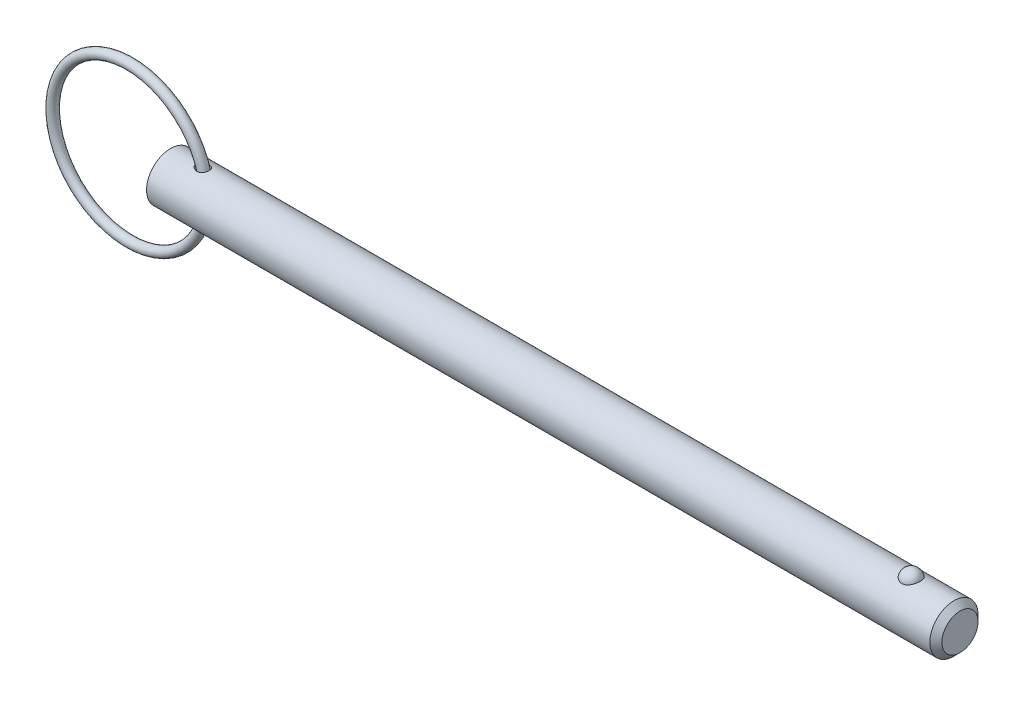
ISO-10303-21;
HEADER;
FILE_DESCRIPTION(('STEP AP214'),'2;1');
FILE_NAME('part.step','',(''),(''),'','','');
FILE_SCHEMA(('AUTOMOTIVE_DESIGN { 1 0 10303 214 1 1 1 1 }'));
ENDSEC;
DATA;
#1=APPLICATION_CONTEXT('core data for automotive mechanical design processes');
#2=APPLICATION_PROTOCOL_DEFINITION('international standard','automotive_design',2000,#1);
#3=PRODUCT_CONTEXT('',#1,'mechanical');
#4=PRODUCT('Part','Part','',(#3));
#5=PRODUCT_RELATED_PRODUCT_CATEGORY('part','',(#4));
#6=PRODUCT_DEFINITION_FORMATION('','',#4);
#7=PRODUCT_DEFINITION_CONTEXT('part definition',#1,'design');
#8=PRODUCT_DEFINITION('design','',#6,#7);
#9=PRODUCT_DEFINITION_SHAPE('','',#8);
#10=(LENGTH_UNIT() NAMED_UNIT(*) SI_UNIT(.MILLI.,.METRE.));
#11=(NAMED_UNIT(*) PLANE_ANGLE_UNIT() SI_UNIT($,.RADIAN.));
#12=(NAMED_UNIT(*) SI_UNIT($,.STERADIAN.) SOLID_ANGLE_UNIT());
#13=UNCERTAINTY_MEASURE_WITH_UNIT(LENGTH_MEASURE(1.E-05),#10,'distance_accuracy_value','');
#14=(GEOMETRIC_REPRESENTATION_CONTEXT(3) GLOBAL_UNCERTAINTY_ASSIGNED_CONTEXT((#13)) GLOBAL_UNIT_ASSIGNED_CONTEXT((#10,
#11,#12)) REPRESENTATION_CONTEXT('',''));
#15=CARTESIAN_POINT('',(0.,0.,0.));
#16=DIRECTION('',(0.,0.,1.));
#17=DIRECTION('',(1.,0.,0.));
#18=AXIS2_PLACEMENT_3D('',#15,#16,#17);
#19=CARTESIAN_POINT('',(-6.75433730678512,0.,0.));
#20=DIRECTION('',(0.,0.,1.));
#21=DIRECTION('',(1.,0.,0.));
#22=AXIS2_PLACEMENT_3D('',#19,#20,#21);
#23=TOROIDAL_SURFACE('',#22,12.7,0.794);
#24=CARTESIAN_POINT('',(6.73966269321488,0.,0.));
#25=VERTEX_POINT('',#24);
#26=VERTEX_LOOP('',#25);
#27=FACE_BOUND('',#26,.T.);
#28=ADVANCED_FACE('P0_F12',(#27),#23,.T.);
#29=CLOSED_SHELL('',(#28));
#30=MANIFOLD_SOLID_BREP('P0_B1',#29);
#31=CARTESIAN_POINT('',(0.,0.,0.));
#32=DIRECTION('',(1.,0.,0.));
#33=DIRECTION('',(0.,0.,-1.));
#34=AXIS2_PLACEMENT_3D('',#31,#32,#33);
#35=CYLINDRICAL_SURFACE('',#34,3.97);
#36=CARTESIAN_POINT('',(4.50613409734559,3.92152479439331,-0.618499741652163));
#37=CARTESIAN_POINT('',(4.54853517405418,3.91408351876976,-0.665679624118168));
#38=CARTESIAN_POINT('',(4.59520918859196,3.90637054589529,-0.709047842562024));
#39=CARTESIAN_POINT('',(4.69529850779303,3.89134328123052,-0.787367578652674));
#40=CARTESIAN_POINT('',(4.74872860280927,3.88402991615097,-0.822300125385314));
#41=CARTESIAN_POINT('',(4.86059505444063,3.87069188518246,-0.882953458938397));
#42=CARTESIAN_POINT('',(4.91902090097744,3.86466460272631,-0.908693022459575));
#43=CARTESIAN_POINT('',(5.03942053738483,3.85463812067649,-0.950329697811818));
#44=CARTESIAN_POINT('',(5.10139227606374,3.85063776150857,-0.966232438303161));
#45=CARTESIAN_POINT('',(5.22799334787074,3.84521819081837,-0.987584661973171));
#46=CARTESIAN_POINT('',(5.29264515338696,3.84382942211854,-0.992910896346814));
#47=CARTESIAN_POINT('',(5.4218778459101,3.84405510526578,-0.992040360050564));
#48=CARTESIAN_POINT('',(5.48645875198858,3.84566813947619,-0.985849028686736));
#49=CARTESIAN_POINT('',(5.60832575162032,3.85155853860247,-0.962561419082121));
#50=CARTESIAN_POINT('',(5.66579014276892,3.85562063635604,-0.946343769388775));
#51=CARTESIAN_POINT('',(5.77675338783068,3.86576598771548,-0.904004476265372));
#52=CARTESIAN_POINT('',(5.83025379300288,3.87184844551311,-0.877886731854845));
#53=CARTESIAN_POINT('',(5.92811265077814,3.88482601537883,-0.818464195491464));
#54=CARTESIAN_POINT('',(5.97284196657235,3.89164057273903,-0.785750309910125));
#55=CARTESIAN_POINT('',(6.05599619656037,3.90559314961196,-0.713164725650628));
#56=CARTESIAN_POINT('',(6.09442162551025,3.91273114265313,-0.673293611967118));
#57=CARTESIAN_POINT('',(6.16349552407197,3.92643411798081,-0.588089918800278));
#58=CARTESIAN_POINT('',(6.19423746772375,3.93300527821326,-0.542833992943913));
#59=CARTESIAN_POINT('',(6.24784048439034,3.94496273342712,-0.447731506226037));
#60=CARTESIAN_POINT('',(6.27070130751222,3.95034899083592,-0.3978847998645));
#61=CARTESIAN_POINT('',(6.30819009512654,3.95940331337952,-0.294515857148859));
#62=CARTESIAN_POINT('',(6.32274046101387,3.96305513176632,-0.240964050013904));
#63=CARTESIAN_POINT('',(6.34295490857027,3.96817541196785,-0.132107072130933));
#64=CARTESIAN_POINT('',(6.3486187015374,3.96964380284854,-0.0768018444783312));
#65=CARTESIAN_POINT('',(6.35094049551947,3.97024250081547,0.0343098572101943));
#66=CARTESIAN_POINT('',(6.34754972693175,3.96936014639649,0.0901174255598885));
#67=CARTESIAN_POINT('',(6.33173352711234,3.9653248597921,0.200354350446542));
#68=CARTESIAN_POINT('',(6.31930791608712,3.96217188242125,0.254783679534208));
#69=CARTESIAN_POINT('',(6.28569545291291,3.95393415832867,0.360736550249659));
#70=CARTESIAN_POINT('',(6.26450524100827,3.94884867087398,0.412258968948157));
#71=CARTESIAN_POINT('',(6.21385621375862,3.93730247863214,0.510898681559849));
#72=CARTESIAN_POINT('',(6.18439757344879,3.93084180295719,0.558016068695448));
#73=CARTESIAN_POINT('',(6.11807283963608,3.91729312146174,0.646300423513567));
#74=CARTESIAN_POINT('',(6.08123803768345,3.91020783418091,0.687491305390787));
#75=CARTESIAN_POINT('',(6.00105036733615,3.89618447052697,0.762970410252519));
#76=CARTESIAN_POINT('',(5.95769831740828,3.88924637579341,0.79725949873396));
#77=CARTESIAN_POINT('',(5.8661353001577,3.87636375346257,0.857702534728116));
#78=CARTESIAN_POINT('',(5.81797537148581,3.87041026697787,0.883931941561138));
#79=CARTESIAN_POINT('',(5.71784316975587,3.86006042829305,0.928089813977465));
#80=CARTESIAN_POINT('',(5.66587104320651,3.85566401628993,0.946018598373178));
#81=CARTESIAN_POINT('',(5.55935910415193,3.84884784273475,0.973381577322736));
#82=CARTESIAN_POINT('',(5.50480823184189,3.84643760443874,0.982774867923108));
#83=CARTESIAN_POINT('',(5.39486598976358,3.84381055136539,0.992999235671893));
#84=CARTESIAN_POINT('',(5.33947443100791,3.84359423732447,0.993828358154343));
#85=CARTESIAN_POINT('',(5.2264823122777,3.84533176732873,0.987084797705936));
#86=CARTESIAN_POINT('',(5.16890896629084,3.84739412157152,0.979092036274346));
#87=CARTESIAN_POINT('',(5.05572652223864,3.85355237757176,0.954563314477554));
#88=CARTESIAN_POINT('',(5.00011821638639,3.85764908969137,0.938023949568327));
#89=CARTESIAN_POINT('',(4.88760177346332,3.86780726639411,0.895259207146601));
#90=CARTESIAN_POINT('',(4.83096658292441,3.87400321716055,0.868345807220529));
#91=CARTESIAN_POINT('',(4.72283286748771,3.88749324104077,0.805802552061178));
#92=CARTESIAN_POINT('',(4.6713374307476,3.89478796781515,0.770167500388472));
#93=CARTESIAN_POINT('',(4.57320957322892,3.90992457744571,0.689306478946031));
#94=CARTESIAN_POINT('',(4.52683185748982,3.91777672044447,0.643771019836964));
#95=CARTESIAN_POINT('',(4.44324307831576,3.93275681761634,0.544809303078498));
#96=CARTESIAN_POINT('',(4.40602610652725,3.939885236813,0.491388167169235));
#97=CARTESIAN_POINT('',(4.34571986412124,3.95183347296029,0.382912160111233));
#98=CARTESIAN_POINT('',(4.32168268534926,3.95680025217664,0.328404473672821));
#99=CARTESIAN_POINT('',(4.28478280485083,3.96454157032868,0.215602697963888));
#100=CARTESIAN_POINT('',(4.27190231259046,3.96731959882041,0.157314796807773));
#101=CARTESIAN_POINT('',(4.25937356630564,3.97002560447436,0.0481762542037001));
#102=CARTESIAN_POINT('',(4.25802727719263,3.97031923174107,-0.00247526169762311));
#103=CARTESIAN_POINT('',(4.26422295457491,3.96897737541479,-0.103210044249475));
#104=CARTESIAN_POINT('',(4.27176468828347,3.96734194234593,-0.153293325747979));
#105=CARTESIAN_POINT('',(4.29457390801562,3.96248430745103,-0.248530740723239));
#106=CARTESIAN_POINT('',(4.30937736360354,3.95935769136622,-0.293803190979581));
#107=CARTESIAN_POINT('',(4.34569993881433,3.95187968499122,-0.381417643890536));
#108=CARTESIAN_POINT('',(4.36721517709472,3.94752900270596,-0.42376132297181));
#109=CARTESIAN_POINT('',(4.40821696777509,3.93952317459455,-0.491758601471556));
#110=CARTESIAN_POINT('',(4.42613511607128,3.93609353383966,-0.518404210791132));
#111=CARTESIAN_POINT('',(4.46438343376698,3.92897396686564,-0.569857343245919));
#112=CARTESIAN_POINT('',(4.48471350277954,3.92528405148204,-0.594664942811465));
#113=CARTESIAN_POINT('',(4.50613409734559,3.92152479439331,-0.618499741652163));
#114=B_SPLINE_CURVE_WITH_KNOTS('',3,(#36,#37,#38,#39,#40,#41,#42,#43,#44,#45,#46,#47,#48,#49,
#50,#51,#52,#53,#54,#55,#56,#57,#58,#59,#60,#61,#62,#63,#64,#65,#66,#67,#68,#69,#70,#71,#72,#73,
#74,#75,#76,#77,#78,#79,#80,#81,#82,#83,#84,#85,#86,#87,#88,#89,#90,#91,#92,#93,#94,#95,#96,#97,
#98,#99,#100,#101,#102,#103,#104,#105,#106,#107,#108,#109,#110,#111,#112,#113),.UNSPECIFIED.,
.T.,.F.,(4,2,2,2,2,2,2,2,2,2,2,2,2,2,2,2,2,2,2,2,2,2,2,2,2,2,2,2,2,2,2,2,2,2,2,2,2,2,4),(0.,
0.191481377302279,0.383389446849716,0.574903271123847,0.766307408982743,0.959929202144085,
1.15345957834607,1.33205157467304,1.51057330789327,1.67726576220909,1.84394459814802,
2.00848443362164,2.17302948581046,2.33908685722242,2.50514962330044,2.6721086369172,
2.83907097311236,3.00609737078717,3.17312023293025,3.33944900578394,3.5057569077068,
3.67045663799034,3.83515004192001,4.00062859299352,4.16614491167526,4.33989638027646,
4.51371711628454,4.70191549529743,4.8902262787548,5.08559712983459,5.28084164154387,
5.45908728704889,5.63704817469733,5.78825771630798,5.93946329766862,6.08206496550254,
6.22458432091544,6.32132279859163,6.41805725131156),.UNSPECIFIED.);
#115=CARTESIAN_POINT('',(4.50613409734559,3.92152479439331,-0.618499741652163));
#116=VERTEX_POINT('',#115);
#117=EDGE_CURVE('P1_E40',#116,#116,#114,.T.);
#118=ORIENTED_EDGE('',*,*,#117,.T.);
#119=EDGE_LOOP('',(#118));
#120=FACE_BOUND('',#119,.T.);
#121=CARTESIAN_POINT('',(129.1875,0.,0.));
#122=DIRECTION('',(1.,0.,0.));
#123=DIRECTION('',(0.,0.,-1.));
#124=AXIS2_PLACEMENT_3D('',#121,#122,#123);
#125=CIRCLE('',#124,3.97);
#126=CARTESIAN_POINT('',(129.1875,0.,-3.97));
#127=VERTEX_POINT('',#126);
#128=EDGE_CURVE('P1_E25',#127,#127,#125,.T.);
#129=ORIENTED_EDGE('',*,*,#128,.F.);
#130=EDGE_LOOP('',(#129));
#131=FACE_BOUND('',#130,.T.);
#132=CARTESIAN_POINT('',(0.,0.,0.));
#133=DIRECTION('',(1.,0.,0.));
#134=DIRECTION('',(0.,0.,-1.));
#135=AXIS2_PLACEMENT_3D('',#132,#133,#134);
#136=CIRCLE('',#135,3.97);
#137=CARTESIAN_POINT('',(0.,0.,-3.97));
#138=VERTEX_POINT('',#137);
#139=EDGE_CURVE('P1_E9',#138,#138,#136,.T.);
#140=ORIENTED_EDGE('',*,*,#139,.T.);
#141=EDGE_LOOP('',(#140));
#142=FACE_BOUND('',#141,.T.);
#143=CARTESIAN_POINT('',(122.145192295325,3.65715365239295,1.54470941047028));
#144=CARTESIAN_POINT('',(122.065244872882,3.65716001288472,1.54470290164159));
#145=CARTESIAN_POINT('',(121.985165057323,3.65987074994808,1.53832549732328));
#146=CARTESIAN_POINT('',(121.827237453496,3.6704221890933,1.51297018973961));
#147=CARTESIAN_POINT('',(121.74939614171,3.67827646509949,1.49395894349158));
#148=CARTESIAN_POINT('',(121.598461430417,3.69818848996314,1.44395950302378));
#149=CARTESIAN_POINT('',(121.525356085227,3.71023513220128,1.41300293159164));
#150=CARTESIAN_POINT('',(121.385563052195,3.7372183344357,1.34000212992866));
#151=CARTESIAN_POINT('',(121.318872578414,3.75215363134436,1.29796274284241));
#152=CARTESIAN_POINT('',(121.19148864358,3.78384968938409,1.20248834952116));
#153=CARTESIAN_POINT('',(121.131029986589,3.80065129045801,1.14875388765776));
#154=CARTESIAN_POINT('',(121.019694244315,3.83398532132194,1.03205417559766));
#155=CARTESIAN_POINT('',(120.968820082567,3.85051766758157,0.969086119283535));
#156=CARTESIAN_POINT('',(120.875632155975,3.88238608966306,0.832526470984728));
#157=CARTESIAN_POINT('',(120.833796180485,3.89763698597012,0.758588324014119));
#158=CARTESIAN_POINT('',(120.76251087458,3.92451063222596,0.604352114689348));
#159=CARTESIAN_POINT('',(120.733062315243,3.93613315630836,0.524053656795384));
#160=CARTESIAN_POINT('',(120.686892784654,3.95467606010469,0.35840348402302));
#161=CARTESIAN_POINT('',(120.670312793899,3.96154426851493,0.273006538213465));
#162=CARTESIAN_POINT('',(120.650756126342,3.96967008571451,0.100408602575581));
#163=CARTESIAN_POINT('',(120.647778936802,3.97092790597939,0.0132076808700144));
#164=CARTESIAN_POINT('',(120.655458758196,3.96771794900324,-0.159844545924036));
#165=CARTESIAN_POINT('',(120.666016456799,3.96329187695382,-0.245701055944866));
#166=CARTESIAN_POINT('',(120.70038009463,3.94923163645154,-0.414277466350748));
#167=CARTESIAN_POINT('',(120.724186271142,3.93959737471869,-0.496997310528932));
#168=CARTESIAN_POINT('',(120.78461142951,3.91607752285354,-0.657113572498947));
#169=CARTESIAN_POINT('',(120.821249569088,3.90218558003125,-0.734501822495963));
#170=CARTESIAN_POINT('',(120.906593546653,3.87158287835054,-0.881704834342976));
#171=CARTESIAN_POINT('',(120.955300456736,3.8548718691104,-0.95151892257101));
#172=CARTESIAN_POINT('',(121.064116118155,3.82028735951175,-1.08208159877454));
#173=CARTESIAN_POINT('',(121.124295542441,3.80240713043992,-1.14276958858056));
#174=CARTESIAN_POINT('',(121.254493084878,3.76758161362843,-1.2528243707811));
#175=CARTESIAN_POINT('',(121.324510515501,3.75063626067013,-1.30219195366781));
#176=CARTESIAN_POINT('',(121.47118160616,3.71998948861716,-1.38729709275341));
#177=CARTESIAN_POINT('',(121.547681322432,3.70623183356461,-1.42327904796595));
#178=CARTESIAN_POINT('',(121.706298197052,3.68323188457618,-1.48178996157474));
#179=CARTESIAN_POINT('',(121.7884132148,3.67398788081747,-1.5043240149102));
#180=CARTESIAN_POINT('',(121.951481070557,3.6615216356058,-1.53440939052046));
#181=CARTESIAN_POINT('',(122.032284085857,3.65801951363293,-1.54265826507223));
#182=CARTESIAN_POINT('',(122.19420850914,3.65657341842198,-1.5460842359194));
#183=CARTESIAN_POINT('',(122.275329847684,3.65862829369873,-1.54126404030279));
#184=CARTESIAN_POINT('',(122.432812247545,3.66788969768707,-1.51908474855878));
#185=CARTESIAN_POINT('',(122.509242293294,3.67492621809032,-1.50213925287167));
#186=CARTESIAN_POINT('',(122.658041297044,3.6931840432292,-1.45666982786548));
#187=CARTESIAN_POINT('',(122.730409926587,3.70440568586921,-1.42814496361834));
#188=CARTESIAN_POINT('',(122.870802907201,3.73012749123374,-1.35956319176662));
#189=CARTESIAN_POINT('',(122.938700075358,3.74469307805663,-1.31927107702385));
#190=CARTESIAN_POINT('',(123.066864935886,3.77545272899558,-1.22847440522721));
#191=CARTESIAN_POINT('',(123.127130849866,3.79164717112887,-1.17796747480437));
#192=CARTESIAN_POINT('',(123.241634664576,3.82490325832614,-1.06519260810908));
#193=CARTESIAN_POINT('',(123.295413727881,3.84196735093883,-1.00245914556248));
#194=CARTESIAN_POINT('',(123.392098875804,3.87439863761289,-0.868715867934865));
#195=CARTESIAN_POINT('',(123.435003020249,3.88976552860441,-0.797704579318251));
#196=CARTESIAN_POINT('',(123.510266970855,3.91771381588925,-0.646896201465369));
#197=CARTESIAN_POINT('',(123.54225322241,3.93019255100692,-0.566893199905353));
#198=CARTESIAN_POINT('',(123.593110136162,3.95043886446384,-0.402255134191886));
#199=CARTESIAN_POINT('',(123.611980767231,3.95820643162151,-0.317620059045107));
#200=CARTESIAN_POINT('',(123.63621625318,3.96823733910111,-0.146156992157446));
#201=CARTESIAN_POINT('',(123.641587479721,3.970503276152,-0.0593300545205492));
#202=CARTESIAN_POINT('',(123.638730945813,3.96930811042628,0.114057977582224));
#203=CARTESIAN_POINT('',(123.630503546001,3.9658471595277,0.200619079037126));
#204=CARTESIAN_POINT('',(123.600706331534,3.95358562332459,0.370506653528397));
#205=CARTESIAN_POINT('',(123.57921294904,3.94481563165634,0.453848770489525));
#206=CARTESIAN_POINT('',(123.52338397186,3.92284586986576,0.615497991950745));
#207=CARTESIAN_POINT('',(123.489047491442,3.90964579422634,0.69380474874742));
#208=CARTESIAN_POINT('',(123.407970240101,3.88006987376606,0.843703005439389));
#209=CARTESIAN_POINT('',(123.361153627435,3.86367478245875,0.915249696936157));
#210=CARTESIAN_POINT('',(123.256189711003,3.82949741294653,1.04910810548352));
#211=CARTESIAN_POINT('',(123.198042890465,3.81171519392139,1.11142021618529));
#212=CARTESIAN_POINT('',(123.071743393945,3.77673366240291,1.22503948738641));
#213=CARTESIAN_POINT('',(123.003597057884,3.75953398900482,1.2763535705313));
#214=CARTESIAN_POINT('',(122.858900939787,3.72770506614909,1.36653336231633));
#215=CARTESIAN_POINT('',(122.782348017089,3.71307678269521,1.40539439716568));
#216=CARTESIAN_POINT('',(122.625759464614,3.68864287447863,1.46830480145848));
#217=CARTESIAN_POINT('',(122.545930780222,3.67869017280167,1.49281289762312));
#218=CARTESIAN_POINT('',(122.382987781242,3.66414535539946,1.52817474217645));
#219=CARTESIAN_POINT('',(122.299884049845,3.65953723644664,1.53906926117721));
#220=CARTESIAN_POINT('',(122.192776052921,3.6573894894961,1.54414878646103));
#221=CARTESIAN_POINT('',(122.168990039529,3.65715175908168,1.54471134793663));
#222=CARTESIAN_POINT('',(122.145192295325,3.65715365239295,1.54470941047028));
#223=B_SPLINE_CURVE_WITH_KNOTS('',3,(#143,#144,#145,#146,#147,#148,#149,#150,#151,#152,#153,
#154,#155,#156,#157,#158,#159,#160,#161,#162,#163,#164,#165,#166,#167,#168,#169,#170,#171,#172,
#173,#174,#175,#176,#177,#178,#179,#180,#181,#182,#183,#184,#185,#186,#187,#188,#189,#190,#191,
#192,#193,#194,#195,#196,#197,#198,#199,#200,#201,#202,#203,#204,#205,#206,#207,#208,#209,#210,
#211,#212,#213,#214,#215,#216,#217,#218,#219,#220,#221,#222),.UNSPECIFIED.,.T.,.F.,(4,2,2,2,2,2,
2,2,2,2,2,2,2,2,2,2,2,2,2,2,2,2,2,2,2,2,2,2,2,2,2,2,2,2,2,2,2,2,2,4),(0.,0.239777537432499,
0.480190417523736,0.719971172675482,0.959647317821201,1.20639040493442,1.45320863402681,
1.7109367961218,1.96868099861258,2.22921052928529,2.48973023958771,2.74834928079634,
3.00697295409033,3.26598440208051,3.52501886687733,3.78570385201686,4.04637062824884,
4.30201257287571,4.55755760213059,4.80022994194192,5.04285200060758,5.27757006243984,
5.51230707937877,5.75210128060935,5.99195126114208,6.24392810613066,6.49594987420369,
6.75588818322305,7.01582710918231,7.27564332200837,7.53545264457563,7.79377886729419,
8.0521229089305,8.31207418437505,8.57201437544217,8.83179046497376,9.09166393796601,
9.34270057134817,9.59298357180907,9.66435753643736),.UNSPECIFIED.);
#224=CARTESIAN_POINT('',(122.145192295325,3.65715365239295,1.54470941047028));
#225=VERTEX_POINT('',#224);
#226=EDGE_CURVE('P1_E34',#225,#225,#223,.T.);
#227=ORIENTED_EDGE('',*,*,#226,.T.);
#228=EDGE_LOOP('',(#227));
#229=FACE_BOUND('',#228,.T.);
#230=CARTESIAN_POINT('',(4.50613409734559,-3.92152479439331,-0.618499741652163));
#231=CARTESIAN_POINT('',(4.47063221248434,-3.92775524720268,-0.57899519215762));
#232=CARTESIAN_POINT('',(4.43810149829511,-3.93379908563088,-0.536794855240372));
#233=CARTESIAN_POINT('',(4.38017497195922,-3.94493883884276,-0.447628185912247));
#234=CARTESIAN_POINT('',(4.3547746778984,-3.95003534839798,-0.400664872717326));
#235=CARTESIAN_POINT('',(4.3122178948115,-3.95875465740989,-0.302642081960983));
#236=CARTESIAN_POINT('',(4.29511088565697,-3.96236859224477,-0.251560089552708));
#237=CARTESIAN_POINT('',(4.27046538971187,-3.96762012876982,-0.14703606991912));
#238=CARTESIAN_POINT('',(4.26292104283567,-3.96925894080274,-0.0935955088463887));
#239=CARTESIAN_POINT('',(4.25814817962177,-3.97029345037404,0.00916757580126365));
#240=CARTESIAN_POINT('',(4.26009234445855,-3.96986905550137,0.058451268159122));
#241=CARTESIAN_POINT('',(4.27229463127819,-3.96723648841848,0.15592126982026));
#242=CARTESIAN_POINT('',(4.28255257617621,-3.96502835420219,0.204107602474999));
#243=CARTESIAN_POINT('',(4.31040382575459,-3.95915538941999,0.296804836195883));
#244=CARTESIAN_POINT('',(4.32779766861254,-3.95553028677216,0.341378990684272));
#245=CARTESIAN_POINT('',(4.36906896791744,-3.94717481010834,0.427290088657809));
#246=CARTESIAN_POINT('',(4.39294824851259,-3.94244412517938,0.468626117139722));
#247=CARTESIAN_POINT('',(4.44891306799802,-3.93178155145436,0.551268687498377));
#248=CARTESIAN_POINT('',(4.48157347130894,-3.92577737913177,0.592175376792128));
#249=CARTESIAN_POINT('',(4.5525111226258,-3.91346489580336,0.668729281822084));
#250=CARTESIAN_POINT('',(4.59079150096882,-3.90715641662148,0.704373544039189));
#251=CARTESIAN_POINT('',(4.67775521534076,-3.89387548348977,0.774654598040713));
#252=CARTESIAN_POINT('',(4.72714377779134,-3.88693620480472,0.808427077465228));
#253=CARTESIAN_POINT('',(4.83064277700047,-3.8740635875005,0.868022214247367));
#254=CARTESIAN_POINT('',(4.88475591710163,-3.86813083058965,0.893840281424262));
#255=CARTESIAN_POINT('',(5.00110106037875,-3.85749476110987,0.93872983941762));
#256=CARTESIAN_POINT('',(5.06363405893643,-3.85293457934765,0.957062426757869));
#257=CARTESIAN_POINT('',(5.19104406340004,-3.84642688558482,0.98289453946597));
#258=CARTESIAN_POINT('',(5.25592057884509,-3.84447883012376,0.990396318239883));
#259=CARTESIAN_POINT('',(5.38389367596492,-3.84360582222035,0.993779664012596));
#260=CARTESIAN_POINT('',(5.44697893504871,-3.84458391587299,0.990033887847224));
#261=CARTESIAN_POINT('',(5.57135239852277,-3.84935403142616,0.971322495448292));
#262=CARTESIAN_POINT('',(5.63264168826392,-3.85314431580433,0.956363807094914));
#263=CARTESIAN_POINT('',(5.74616757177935,-3.86267246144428,0.917075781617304));
#264=CARTESIAN_POINT('',(5.79873169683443,-3.86821908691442,0.893643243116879));
#265=CARTESIAN_POINT('',(5.89880370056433,-3.88065529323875,0.837987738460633));
#266=CARTESIAN_POINT('',(5.94631268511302,-3.88754457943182,0.805766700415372));
#267=CARTESIAN_POINT('',(6.03285109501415,-3.90151699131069,0.735052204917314));
#268=CARTESIAN_POINT('',(6.07216200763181,-3.90857818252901,0.696897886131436));
#269=CARTESIAN_POINT('',(6.14379115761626,-3.92238187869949,0.614461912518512));
#270=CARTESIAN_POINT('',(6.17610956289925,-3.92912439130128,0.570180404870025));
#271=CARTESIAN_POINT('',(6.23298117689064,-3.94155789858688,0.47670081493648));
#272=CARTESIAN_POINT('',(6.25752764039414,-3.94724797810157,0.427498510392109));
#273=CARTESIAN_POINT('',(6.29825018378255,-3.95695712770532,0.325589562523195));
#274=CARTESIAN_POINT('',(6.31442591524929,-3.96097612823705,0.272882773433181));
#275=CARTESIAN_POINT('',(6.33815165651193,-3.96694319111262,0.164947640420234));
#276=CARTESIAN_POINT('',(6.34562253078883,-3.96887224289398,0.109700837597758));
#277=CARTESIAN_POINT('',(6.35150690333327,-3.97038782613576,-0.00130546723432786));
#278=CARTESIAN_POINT('',(6.34992017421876,-3.96997429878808,-0.0570649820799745));
#279=CARTESIAN_POINT('',(6.33770614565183,-3.96684417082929,-0.167685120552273));
#280=CARTESIAN_POINT('',(6.32705245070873,-3.96412084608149,-0.222542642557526));
#281=CARTESIAN_POINT('',(6.29690849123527,-3.95665587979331,-0.329631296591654));
#282=CARTESIAN_POINT('',(6.27741810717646,-3.95191421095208,-0.381862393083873));
#283=CARTESIAN_POINT('',(6.2300755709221,-3.94093577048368,-0.482151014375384));
#284=CARTESIAN_POINT('',(6.20223216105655,-3.93470056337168,-0.530212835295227));
#285=CARTESIAN_POINT('',(6.13885089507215,-3.92142345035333,-0.620836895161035));
#286=CARTESIAN_POINT('',(6.10331353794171,-3.9143815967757,-0.663399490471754));
#287=CARTESIAN_POINT('',(6.02573506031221,-3.90033441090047,-0.741525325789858));
#288=CARTESIAN_POINT('',(5.98374081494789,-3.89332916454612,-0.777135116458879));
#289=CARTESIAN_POINT('',(5.89422937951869,-3.88009391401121,-0.840731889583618));
#290=CARTESIAN_POINT('',(5.84671289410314,-3.87386381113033,-0.868719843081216));
#291=CARTESIAN_POINT('',(5.74792005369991,-3.86290904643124,-0.916201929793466));
#292=CARTESIAN_POINT('',(5.69667597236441,-3.85817300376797,-0.935760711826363));
#293=CARTESIAN_POINT('',(5.59158164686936,-3.85061943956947,-0.966374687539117));
#294=CARTESIAN_POINT('',(5.53773121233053,-3.84780205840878,-0.97742925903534));
#295=CARTESIAN_POINT('',(5.42780663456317,-3.844282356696,-0.991183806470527));
#296=CARTESIAN_POINT('',(5.37170954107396,-3.84362414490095,-0.993709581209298));
#297=CARTESIAN_POINT('',(5.25980914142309,-3.84452352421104,-0.990222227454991));
#298=CARTESIAN_POINT('',(5.20400591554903,-3.84608169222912,-0.984206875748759));
#299=CARTESIAN_POINT('',(5.09021941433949,-3.85134557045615,-0.963410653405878));
#300=CARTESIAN_POINT('',(5.0323470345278,-3.85519050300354,-0.948059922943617));
#301=CARTESIAN_POINT('',(4.9197292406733,-3.86464451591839,-0.908751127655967));
#302=CARTESIAN_POINT('',(4.86498619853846,-3.87025491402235,-0.884786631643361));
#303=CARTESIAN_POINT('',(4.75497621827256,-3.88320265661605,-0.826208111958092));
#304=CARTESIAN_POINT('',(4.70013922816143,-3.89065244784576,-0.790807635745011));
#305=CARTESIAN_POINT('',(4.59743373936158,-3.90600301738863,-0.711112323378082));
#306=CARTESIAN_POINT('',(4.54956105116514,-3.91390352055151,-0.66682287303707));
#307=CARTESIAN_POINT('',(4.50613409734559,-3.92152479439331,-0.618499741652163));
#308=B_SPLINE_CURVE_WITH_KNOTS('',3,(#230,#231,#232,#233,#234,#235,#236,#237,#238,#239,#240,
#241,#242,#243,#244,#245,#246,#247,#248,#249,#250,#251,#252,#253,#254,#255,#256,#257,#258,#259,
#260,#261,#262,#263,#264,#265,#266,#267,#268,#269,#270,#271,#272,#273,#274,#275,#276,#277,#278,
#279,#280,#281,#282,#283,#284,#285,#286,#287,#288,#289,#290,#291,#292,#293,#294,#295,#296,#297,
#298,#299,#300,#301,#302,#303,#304,#305,#306,#307),.UNSPECIFIED.,.T.,.F.,(4,2,2,2,2,2,2,2,2,2,2,
2,2,2,2,2,2,2,2,2,2,2,2,2,2,2,2,2,2,2,2,2,2,2,2,2,2,2,4),(0.,0.160252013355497,
0.320403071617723,0.481498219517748,0.642494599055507,0.789717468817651,0.936937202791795,
1.08029540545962,1.22369397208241,1.38114509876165,1.53868426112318,1.7186296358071,
1.89867865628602,2.09368931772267,2.28865940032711,2.47724174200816,2.66570766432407,
2.83827720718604,3.01080892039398,3.17573461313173,3.34065634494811,3.50572082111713,
3.67079216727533,3.83735274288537,4.00391749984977,4.17096882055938,4.33802240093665,
4.50490174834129,4.6717702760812,4.83748008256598,5.0031687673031,5.16756302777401,
5.3319693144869,5.49971393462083,5.66750222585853,5.84673431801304,6.02610050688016,
6.22224398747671,6.41826898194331),.UNSPECIFIED.);
#309=CARTESIAN_POINT('',(4.50613409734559,-3.92152479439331,-0.618499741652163));
#310=VERTEX_POINT('',#309);
#311=EDGE_CURVE('P1_E17',#310,#310,#308,.T.);
#312=ORIENTED_EDGE('',*,*,#311,.T.);
#313=EDGE_LOOP('',(#312));
#314=FACE_BOUND('',#313,.T.);
#315=ADVANCED_FACE('P1_F13',(#120,#131,#142,#229,#314),#35,.T.);
#316=CARTESIAN_POINT('',(0.,0.,0.));
#317=DIRECTION('',(-1.,0.,0.));
#318=DIRECTION('',(0.,0.,1.));
#319=AXIS2_PLACEMENT_3D('',#316,#317,#318);
#320=PLANE('',#319);
#321=ORIENTED_EDGE('',*,*,#139,.F.);
#322=EDGE_LOOP('',(#321));
#323=FACE_BOUND('',#322,.T.);
#324=ADVANCED_FACE('P1_F15',(#323),#320,.T.);
#325=CARTESIAN_POINT('',(130.18,0.,0.));
#326=DIRECTION('',(-1.,0.,0.));
#327=DIRECTION('',(0.,0.,1.));
#328=AXIS2_PLACEMENT_3D('',#325,#326,#327);
#329=CONICAL_SURFACE('',#328,2.97750000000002,0.785398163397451);
#330=ORIENTED_EDGE('',*,*,#128,.T.);
#331=EDGE_LOOP('',(#330));
#332=FACE_BOUND('',#331,.T.);
#333=CARTESIAN_POINT('',(130.18,0.,0.));
#334=DIRECTION('',(1.,0.,0.));
#335=DIRECTION('',(0.,0.,-1.));
#336=AXIS2_PLACEMENT_3D('',#333,#334,#335);
#337=CIRCLE('',#336,2.97750000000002);
#338=CARTESIAN_POINT('',(130.18,0.,-2.97750000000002));
#339=VERTEX_POINT('',#338);
#340=EDGE_CURVE('P1_E30',#339,#339,#337,.T.);
#341=ORIENTED_EDGE('',*,*,#340,.F.);
#342=EDGE_LOOP('',(#341));
#343=FACE_BOUND('',#342,.T.);
#344=ADVANCED_FACE('P1_F55',(#332,#343),#329,.T.);
#345=CARTESIAN_POINT('',(130.18,2.97750000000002,0.));
#346=DIRECTION('',(1.,0.,0.));
#347=DIRECTION('',(0.,0.,-1.));
#348=AXIS2_PLACEMENT_3D('',#345,#346,#347);
#349=PLANE('',#348);
#350=ORIENTED_EDGE('',*,*,#340,.T.);
#351=EDGE_LOOP('',(#350));
#352=FACE_BOUND('',#351,.T.);
#353=ADVANCED_FACE('P1_F51',(#352),#349,.T.);
#354=CARTESIAN_POINT('',(122.145192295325,3.573,0.));
#355=DIRECTION('',(-1.,0.,0.));
#356=DIRECTION('',(0.,1.,0.));
#357=AXIS2_PLACEMENT_3D('',#354,#355,#356);
#358=SPHERICAL_SURFACE('',#357,1.54699999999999);
#359=ORIENTED_EDGE('',*,*,#226,.F.);
#360=EDGE_LOOP('',(#359));
#361=FACE_BOUND('',#360,.T.);
#362=ADVANCED_FACE('P1_F46',(#361),#358,.T.);
#363=CARTESIAN_POINT('',(-6.75433730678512,0.,0.));
#364=DIRECTION('',(0.,0.,1.));
#365=DIRECTION('',(1.,0.,0.));
#366=AXIS2_PLACEMENT_3D('',#363,#364,#365);
#367=TOROIDAL_SURFACE('',#366,12.7,0.9925);
#368=ORIENTED_EDGE('',*,*,#311,.F.);
#369=EDGE_LOOP('',(#368));
#370=FACE_BOUND('',#369,.T.);
#371=ORIENTED_EDGE('',*,*,#117,.F.);
#372=EDGE_LOOP('',(#371));
#373=FACE_BOUND('',#372,.T.);
#374=ADVANCED_FACE('P1_F50',(#370,#373),#367,.F.);
#375=CLOSED_SHELL('',(#315,#324,#344,#353,#362,#374));
#376=MANIFOLD_SOLID_BREP('P1_B1',#375);
#377=ADVANCED_BREP_SHAPE_REPRESENTATION('',(#18,#30,#376),#14);
#378=SHAPE_DEFINITION_REPRESENTATION(#9,#377);
ENDSEC;
END-ISO-10303-21;
